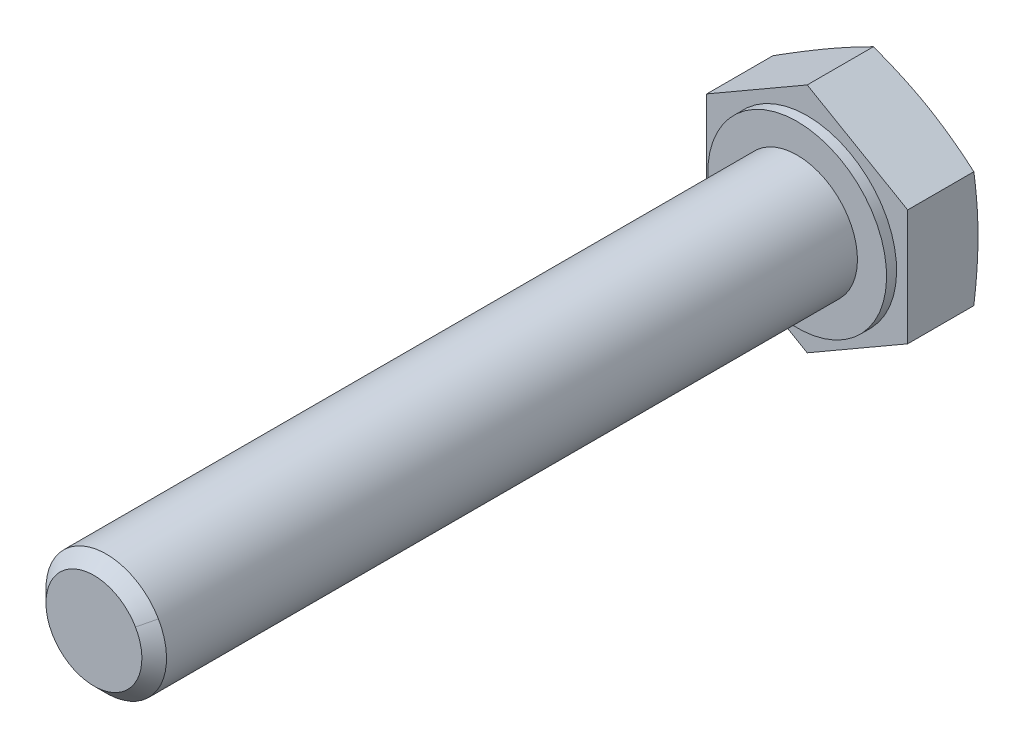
ISO-10303-21;
HEADER;
FILE_DESCRIPTION(('STEP AP214'),'2;1');
FILE_NAME('part.step','',(''),(''),'','','');
FILE_SCHEMA(('AUTOMOTIVE_DESIGN { 1 0 10303 214 1 1 1 1 }'));
ENDSEC;
DATA;
#1=APPLICATION_CONTEXT('core data for automotive mechanical design processes');
#2=APPLICATION_PROTOCOL_DEFINITION('international standard','automotive_design',2000,#1);
#3=PRODUCT_CONTEXT('',#1,'mechanical');
#4=PRODUCT('Part','Part','',(#3));
#5=PRODUCT_RELATED_PRODUCT_CATEGORY('part','',(#4));
#6=PRODUCT_DEFINITION_FORMATION('','',#4);
#7=PRODUCT_DEFINITION_CONTEXT('part definition',#1,'design');
#8=PRODUCT_DEFINITION('design','',#6,#7);
#9=PRODUCT_DEFINITION_SHAPE('','',#8);
#10=(LENGTH_UNIT() NAMED_UNIT(*) SI_UNIT(.MILLI.,.METRE.));
#11=(NAMED_UNIT(*) PLANE_ANGLE_UNIT() SI_UNIT($,.RADIAN.));
#12=(NAMED_UNIT(*) SI_UNIT($,.STERADIAN.) SOLID_ANGLE_UNIT());
#13=UNCERTAINTY_MEASURE_WITH_UNIT(LENGTH_MEASURE(1.E-05),#10,'distance_accuracy_value','');
#14=(GEOMETRIC_REPRESENTATION_CONTEXT(3) GLOBAL_UNCERTAINTY_ASSIGNED_CONTEXT((#13)) GLOBAL_UNIT_ASSIGNED_CONTEXT((#10,
#11,#12)) REPRESENTATION_CONTEXT('',''));
#15=CARTESIAN_POINT('',(0.,0.,0.));
#16=DIRECTION('',(0.,0.,1.));
#17=DIRECTION('',(1.,0.,0.));
#18=AXIS2_PLACEMENT_3D('',#15,#16,#17);
#19=CARTESIAN_POINT('',(2.16506350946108,1.25000000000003,0.));
#20=DIRECTION('',(0.,0.,-1.));
#21=DIRECTION('',(0.866025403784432,0.500000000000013,0.));
#22=AXIS2_PLACEMENT_3D('',#19,#20,#21);
#23=PLANE('',#22);
#24=CARTESIAN_POINT('',(0.,0.,-6.63927463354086E-12));
#25=DIRECTION('',(0.,0.,1.));
#26=DIRECTION('',(-0.866025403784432,-0.500000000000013,0.));
#27=AXIS2_PLACEMENT_3D('',#24,#25,#26);
#28=CIRCLE('',#27,4.99999999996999);
#29=CARTESIAN_POINT('',(-2.49999999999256,4.33012701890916,-2.61842660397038E-12));
#30=VERTEX_POINT('',#29);
#31=CARTESIAN_POINT('',(-4.99999999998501,0.,-2.61366202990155E-12));
#32=VERTEX_POINT('',#31);
#33=EDGE_CURVE('E102',#30,#32,#28,.T.);
#34=ORIENTED_EDGE('',*,*,#33,.F.);
#35=CARTESIAN_POINT('',(0.,0.,-6.63978962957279E-12));
#36=DIRECTION('',(0.,0.,1.));
#37=DIRECTION('',(-0.866025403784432,-0.500000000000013,0.));
#38=AXIS2_PLACEMENT_3D('',#35,#36,#37);
#39=CIRCLE('',#38,4.99999999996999);
#40=CARTESIAN_POINT('',(2.49999999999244,4.33012701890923,-2.62254361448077E-12));
#41=VERTEX_POINT('',#40);
#42=EDGE_CURVE('E117',#41,#30,#39,.T.);
#43=ORIENTED_EDGE('',*,*,#42,.F.);
#44=CARTESIAN_POINT('',(0.,0.,-6.63927463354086E-12));
#45=DIRECTION('',(0.,0.,1.));
#46=DIRECTION('',(-0.866025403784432,-0.500000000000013,0.));
#47=AXIS2_PLACEMENT_3D('',#44,#45,#46);
#48=CIRCLE('',#47,4.99999999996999);
#49=CARTESIAN_POINT('',(4.33012701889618,2.49999999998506,-6.6395042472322E-12));
#50=VERTEX_POINT('',#49);
#51=EDGE_CURVE('E125',#50,#41,#48,.T.);
#52=ORIENTED_EDGE('',*,*,#51,.F.);
#53=CARTESIAN_POINT('',(0.,0.,-6.63978962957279E-12));
#54=DIRECTION('',(0.,0.,1.));
#55=DIRECTION('',(-0.866025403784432,-0.500000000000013,0.));
#56=AXIS2_PLACEMENT_3D('',#53,#54,#55);
#57=CIRCLE('',#56,4.99999999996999);
#58=CARTESIAN_POINT('',(4.999999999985,0.,-2.61392716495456E-12));
#59=VERTEX_POINT('',#58);
#60=EDGE_CURVE('E382',#59,#50,#57,.T.);
#61=ORIENTED_EDGE('',*,*,#60,.F.);
#62=CARTESIAN_POINT('',(0.,0.,-6.63927463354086E-12));
#63=DIRECTION('',(0.,0.,1.));
#64=DIRECTION('',(-0.866025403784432,-0.500000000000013,0.));
#65=AXIS2_PLACEMENT_3D('',#62,#63,#64);
#66=CIRCLE('',#65,4.99999999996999);
#67=CARTESIAN_POINT('',(2.49999999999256,-4.33012701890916,-2.61816146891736E-12));
#68=VERTEX_POINT('',#67);
#69=EDGE_CURVE('E357',#68,#59,#66,.T.);
#70=ORIENTED_EDGE('',*,*,#69,.F.);
#71=CARTESIAN_POINT('',(0.,0.,-6.63878674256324E-12));
#72=DIRECTION('',(0.,0.,1.));
#73=DIRECTION('',(-0.866025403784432,-0.500000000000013,0.));
#74=AXIS2_PLACEMENT_3D('',#71,#72,#73);
#75=CIRCLE('',#74,4.99999999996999);
#76=CARTESIAN_POINT('',(-2.49999999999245,-4.33012701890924,-2.62152545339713E-12));
#77=VERTEX_POINT('',#76);
#78=EDGE_CURVE('E379',#77,#68,#75,.T.);
#79=ORIENTED_EDGE('',*,*,#78,.F.);
#80=CARTESIAN_POINT('',(0.,0.,-6.63927463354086E-12));
#81=DIRECTION('',(0.,0.,1.));
#82=DIRECTION('',(-0.866025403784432,-0.500000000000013,0.));
#83=AXIS2_PLACEMENT_3D('',#80,#81,#82);
#84=CIRCLE('',#83,4.99999999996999);
#85=CARTESIAN_POINT('',(-4.33012701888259,-2.49999999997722,-6.63904501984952E-12));
#86=VERTEX_POINT('',#85);
#87=EDGE_CURVE('E105',#86,#77,#84,.T.);
#88=ORIENTED_EDGE('',*,*,#87,.F.);
#89=CARTESIAN_POINT('',(0.,0.,-6.63878674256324E-12));
#90=DIRECTION('',(0.,0.,1.));
#91=DIRECTION('',(-0.866025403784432,-0.500000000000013,0.));
#92=AXIS2_PLACEMENT_3D('',#89,#90,#91);
#93=CIRCLE('',#92,4.99999999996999);
#94=EDGE_CURVE('E17',#32,#86,#93,.T.);
#95=ORIENTED_EDGE('',*,*,#94,.F.);
#96=EDGE_LOOP('',(#34,#43,#52,#61,#70,#79,#88,#95));
#97=FACE_BOUND('',#96,.T.);
#98=ADVANCED_FACE('F14',(#97),#23,.T.);
#99=CARTESIAN_POINT('',(0.,0.,0.208502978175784));
#100=DIRECTION('',(0.,0.,1.));
#101=DIRECTION('',(-0.866025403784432,-0.500000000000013,0.));
#102=AXIS2_PLACEMENT_3D('',#99,#100,#101);
#103=CONICAL_SURFACE('',#102,5.7781437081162,1.30899693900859);
#104=CARTESIAN_POINT('',(-5.,-2.88675134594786,0.207259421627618));
#105=CARTESIAN_POINT('',(-5.,-2.64743939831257,0.175186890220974));
#106=CARTESIAN_POINT('',(-5.00000000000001,-2.40769790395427,0.146063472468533));
#107=CARTESIAN_POINT('',(-5.00000000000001,-1.92774013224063,0.0949189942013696));
#108=CARTESIAN_POINT('',(-5.00000000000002,-1.68752470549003,0.072889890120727));
#109=CARTESIAN_POINT('',(-5.00000000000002,-1.20640156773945,0.0370556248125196));
#110=CARTESIAN_POINT('',(-5.00000000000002,-0.96549370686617,0.0232524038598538));
#111=CARTESIAN_POINT('',(-5.00000000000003,-0.60374322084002,0.00935120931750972));
#112=CARTESIAN_POINT('',(-5.00000000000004,-0.483024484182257,0.00585136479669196));
#113=CARTESIAN_POINT('',(-5.00000000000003,-0.241538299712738,0.00117297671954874));
#114=CARTESIAN_POINT('',(-5.00000000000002,-0.12077085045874,-5.49214909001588E-06));
#115=CARTESIAN_POINT('',(-5.,0.,1.41184511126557E-12));
#116=B_SPLINE_CURVE_WITH_KNOTS('',3,(#104,#105,#106,#107,#108,#109,#110,#111,#112,#113,#114,
#115),.UNSPECIFIED.,.F.,.F.,(4,2,2,2,2,4),(0.,0.724386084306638,1.44794794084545,
2.17168039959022,2.5339691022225,2.89626946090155),.UNSPECIFIED.);
#117=CARTESIAN_POINT('',(-5.00000000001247,-2.88675134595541,0.207259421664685));
#118=VERTEX_POINT('',#117);
#119=EDGE_CURVE('E110',#118,#32,#116,.T.);
#120=ORIENTED_EDGE('',*,*,#119,.T.);
#121=ORIENTED_EDGE('',*,*,#94,.T.);
#122=DIRECTION('',(0.836516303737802,0.482962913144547,-0.258819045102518));
#123=VECTOR('',#122,1.);
#124=CARTESIAN_POINT('',(-432187.37968241,-249523.500000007,133717.900889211));
#125=LINE('',#124,#123);
#126=EDGE_CURVE('E108',#118,#86,#125,.T.);
#127=ORIENTED_EDGE('',*,*,#126,.F.);
#128=EDGE_LOOP('',(#120,#121,#127));
#129=FACE_BOUND('',#128,.T.);
#130=ADVANCED_FACE('F111',(#129),#103,.T.);
#131=CARTESIAN_POINT('',(0.,0.,0.208502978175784));
#132=DIRECTION('',(0.,0.,1.));
#133=DIRECTION('',(-0.866025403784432,-0.500000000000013,0.));
#134=AXIS2_PLACEMENT_3D('',#131,#132,#133);
#135=CONICAL_SURFACE('',#134,5.7781437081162,1.30899693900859);
#136=ORIENTED_EDGE('',*,*,#87,.T.);
#137=CARTESIAN_POINT('',(-2.49999999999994,-4.33012701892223,1.39498280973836E-12));
#138=CARTESIAN_POINT('',(-2.60459062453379,-4.26974159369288,-5.49214910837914E-06));
#139=CARTESIAN_POINT('',(-2.709178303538,-4.20935786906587,0.00117297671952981));
#140=CARTESIAN_POINT('',(-2.91831147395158,-4.08861477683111,0.00585136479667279));
#141=CARTESIAN_POINT('',(-3.02285696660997,-4.02825540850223,0.00935120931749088));
#142=CARTESIAN_POINT('',(-3.33614207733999,-3.84738016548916,0.0232524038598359));
#143=CARTESIAN_POINT('',(-3.54477440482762,-3.72692623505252,0.0370556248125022));
#144=CARTESIAN_POINT('',(-3.96143926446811,-3.48636466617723,0.0728898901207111));
#145=CARTESIAN_POINT('',(-4.16947192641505,-3.36625695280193,0.0949189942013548));
#146=CARTESIAN_POINT('',(-4.58512754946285,-3.12627806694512,0.14606347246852));
#147=CARTESIAN_POINT('',(-4.7927497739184,-3.00640731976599,0.175186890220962));
#148=CARTESIAN_POINT('',(-4.99999999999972,-2.88675134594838,0.207259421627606));
#149=B_SPLINE_CURVE_WITH_KNOTS('',3,(#137,#138,#139,#140,#141,#142,#143,#144,#145,#146,#147,
#148),.UNSPECIFIED.,.F.,.F.,(4,2,2,2,2,4),(0.,0.362300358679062,0.724589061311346,
1.44832152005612,2.17188337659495,2.8962694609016),.UNSPECIFIED.);
#150=EDGE_CURVE('E133',#77,#118,#149,.T.);
#151=ORIENTED_EDGE('',*,*,#150,.T.);
#152=ORIENTED_EDGE('',*,*,#126,.T.);
#153=EDGE_LOOP('',(#136,#151,#152));
#154=FACE_BOUND('',#153,.T.);
#155=ADVANCED_FACE('F416',(#154),#135,.T.);
#156=CARTESIAN_POINT('',(0.,0.,0.208502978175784));
#157=DIRECTION('',(0.,0.,1.));
#158=DIRECTION('',(-0.866025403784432,-0.500000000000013,0.));
#159=AXIS2_PLACEMENT_3D('',#156,#157,#158);
#160=CONICAL_SURFACE('',#159,5.7781437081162,1.30899693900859);
#161=CARTESIAN_POINT('',(1.16053000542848E-12,-5.77350269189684,0.207259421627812));
#162=CARTESIAN_POINT('',(-0.207250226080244,-5.65384671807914,0.175186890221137));
#163=CARTESIAN_POINT('',(-0.414872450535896,-5.53397597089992,0.146063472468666));
#164=CARTESIAN_POINT('',(-0.830528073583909,-5.29399708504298,0.0949189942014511));
#165=CARTESIAN_POINT('',(-1.03856073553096,-5.17388937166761,0.0728898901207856));
#166=CARTESIAN_POINT('',(-1.45522559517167,-4.9333278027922,0.0370556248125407));
#167=CARTESIAN_POINT('',(-1.66385792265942,-4.8128738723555,0.0232524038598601));
#168=CARTESIAN_POINT('',(-1.9771430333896,-4.63199862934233,0.00935120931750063));
#169=CARTESIAN_POINT('',(-2.08168852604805,-4.57163926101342,0.00585136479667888));
#170=CARTESIAN_POINT('',(-2.29082169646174,-4.4508961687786,0.00117297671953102));
#171=CARTESIAN_POINT('',(-2.39540937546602,-4.39051244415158,-5.49214910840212E-06));
#172=CARTESIAN_POINT('',(-2.49999999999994,-4.33012701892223,1.39498280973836E-12));
#173=B_SPLINE_CURVE_WITH_KNOTS('',3,(#161,#162,#163,#164,#165,#166,#167,#168,#169,#170,#171,
#172),.UNSPECIFIED.,.F.,.F.,(4,2,2,2,2,4),(0.,0.724386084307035,1.44794794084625,
2.17168039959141,2.53396910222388,2.89626946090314),.UNSPECIFIED.);
#174=CARTESIAN_POINT('',(1.20563281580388E-13,-5.77350269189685,0.207259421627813));
#175=VERTEX_POINT('',#174);
#176=EDGE_CURVE('E130',#175,#77,#173,.T.);
#177=ORIENTED_EDGE('',*,*,#176,.T.);
#178=ORIENTED_EDGE('',*,*,#78,.T.);
#179=CARTESIAN_POINT('',(2.50000000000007,-4.33012701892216,1.40284623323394E-12));
#180=CARTESIAN_POINT('',(2.39540937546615,-4.39051244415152,-5.49214910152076E-06));
#181=CARTESIAN_POINT('',(2.29082169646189,-4.45089616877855,0.00117297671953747));
#182=CARTESIAN_POINT('',(2.0816885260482,-4.57163926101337,0.0058513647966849));
#183=CARTESIAN_POINT('',(1.97714303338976,-4.63199862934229,0.00935120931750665));
#184=CARTESIAN_POINT('',(1.66385792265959,-4.81287387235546,0.0232524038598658));
#185=CARTESIAN_POINT('',(1.45522559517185,-4.93332780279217,0.0370556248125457));
#186=CARTESIAN_POINT('',(1.03856073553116,-5.17388937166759,0.0728898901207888));
#187=CARTESIAN_POINT('',(0.83052807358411,-5.29399708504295,0.094918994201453));
#188=CARTESIAN_POINT('',(0.414872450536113,-5.53397597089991,0.146063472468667));
#189=CARTESIAN_POINT('',(0.20725022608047,-5.65384671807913,0.175186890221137));
#190=CARTESIAN_POINT('',(-9.22872889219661E-13,-5.77350269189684,0.207259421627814));
#191=B_SPLINE_CURVE_WITH_KNOTS('',3,(#179,#180,#181,#182,#183,#184,#185,#186,#187,#188,#189,
#190),.UNSPECIFIED.,.F.,.F.,(4,2,2,2,2,4),(0.,0.362300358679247,0.724589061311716,
1.44832152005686,2.17188337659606,2.89626946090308),.UNSPECIFIED.);
#192=EDGE_CURVE('E237',#68,#175,#191,.T.);
#193=ORIENTED_EDGE('',*,*,#192,.T.);
#194=EDGE_LOOP('',(#177,#178,#193));
#195=FACE_BOUND('',#194,.T.);
#196=ADVANCED_FACE('F411',(#195),#160,.T.);
#197=CARTESIAN_POINT('',(0.,0.,0.208502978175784));
#198=DIRECTION('',(0.,0.,1.));
#199=DIRECTION('',(-0.866025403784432,-0.500000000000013,0.));
#200=AXIS2_PLACEMENT_3D('',#197,#198,#199);
#201=CONICAL_SURFACE('',#200,5.7781437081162,1.30899693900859);
#202=CARTESIAN_POINT('',(5.,2.88675134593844,0.207259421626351));
#203=CARTESIAN_POINT('',(5.,2.64743939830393,0.175186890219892));
#204=CARTESIAN_POINT('',(5.00000000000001,2.4076979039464,0.146063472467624));
#205=CARTESIAN_POINT('',(5.00000000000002,1.92774013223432,0.0949189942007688));
#206=CARTESIAN_POINT('',(5.00000000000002,1.68752470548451,0.0728898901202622));
#207=CARTESIAN_POINT('',(5.00000000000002,1.20640156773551,0.03705562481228));
#208=CARTESIAN_POINT('',(5.00000000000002,0.965493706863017,0.0232524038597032));
#209=CARTESIAN_POINT('',(5.00000000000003,0.603743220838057,0.00935120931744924));
#210=CARTESIAN_POINT('',(5.00000000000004,0.483024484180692,0.0058513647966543));
#211=CARTESIAN_POINT('',(5.00000000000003,0.241538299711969,0.00117297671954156));
#212=CARTESIAN_POINT('',(5.00000000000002,0.120770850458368,-5.49214908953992E-06));
#213=CARTESIAN_POINT('',(5.,1.02348685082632E-13,1.41209497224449E-12));
#214=B_SPLINE_CURVE_WITH_KNOTS('',3,(#202,#203,#204,#205,#206,#207,#208,#209,#210,#211,#212,
#213),.UNSPECIFIED.,.F.,.F.,(4,2,2,2,2,4),(0.,0.724386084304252,1.44794794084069,
2.17168039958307,2.53396910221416,2.89626946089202),.UNSPECIFIED.);
#215=CARTESIAN_POINT('',(5.00000000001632,2.88675134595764,0.207259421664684));
#216=VERTEX_POINT('',#215);
#217=EDGE_CURVE('E216',#216,#59,#214,.T.);
#218=ORIENTED_EDGE('',*,*,#217,.T.);
#219=ORIENTED_EDGE('',*,*,#60,.T.);
#220=DIRECTION('',(-0.836516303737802,-0.482962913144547,-0.258819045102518));
#221=VECTOR('',#220,1.);
#222=CARTESIAN_POINT('',(432187.37968241,249523.500000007,133717.900889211));
#223=LINE('',#222,#221);
#224=EDGE_CURVE('E354',#216,#50,#223,.T.);
#225=ORIENTED_EDGE('',*,*,#224,.F.);
#226=EDGE_LOOP('',(#218,#219,#225));
#227=FACE_BOUND('',#226,.T.);
#228=ADVANCED_FACE('F226',(#227),#201,.T.);
#229=CARTESIAN_POINT('',(0.,0.,0.208502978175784));
#230=DIRECTION('',(0.,0.,1.));
#231=DIRECTION('',(-0.866025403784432,-0.500000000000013,0.));
#232=AXIS2_PLACEMENT_3D('',#229,#230,#231);
#233=CONICAL_SURFACE('',#232,5.7781437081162,1.30899693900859);
#234=CARTESIAN_POINT('',(5.0000000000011,-2.88675134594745,0.207259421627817));
#235=CARTESIAN_POINT('',(4.7927497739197,-3.00640731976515,0.175186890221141));
#236=CARTESIAN_POINT('',(4.58512754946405,-3.12627806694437,0.146063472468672));
#237=CARTESIAN_POINT('',(4.16947192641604,-3.36625695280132,0.0949189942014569));
#238=CARTESIAN_POINT('',(3.96143926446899,-3.48636466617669,0.0728898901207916));
#239=CARTESIAN_POINT('',(3.54477440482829,-3.72692623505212,0.037055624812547));
#240=CARTESIAN_POINT('',(3.33614207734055,-3.84738016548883,0.0232524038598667));
#241=CARTESIAN_POINT('',(3.02285696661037,-4.028255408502,0.00935120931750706));
#242=CARTESIAN_POINT('',(2.91831147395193,-4.08861477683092,0.00585136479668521));
#243=CARTESIAN_POINT('',(2.70917830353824,-4.20935786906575,0.00117297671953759));
#244=CARTESIAN_POINT('',(2.60459062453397,-4.26974159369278,-5.49214910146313E-06));
#245=CARTESIAN_POINT('',(2.50000000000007,-4.33012701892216,1.40284623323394E-12));
#246=B_SPLINE_CURVE_WITH_KNOTS('',3,(#234,#235,#236,#237,#238,#239,#240,#241,#242,#243,#244,
#245),.UNSPECIFIED.,.F.,.F.,(4,2,2,2,2,4),(0.,0.724386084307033,1.44794794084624,
2.1716803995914,2.53396910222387,2.89626946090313),.UNSPECIFIED.);
#247=CARTESIAN_POINT('',(5.00000000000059,-2.88675134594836,0.207259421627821));
#248=VERTEX_POINT('',#247);
#249=EDGE_CURVE('E231',#248,#68,#246,.T.);
#250=ORIENTED_EDGE('',*,*,#249,.T.);
#251=ORIENTED_EDGE('',*,*,#69,.T.);
#252=CARTESIAN_POINT('',(5.,1.02348685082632E-13,1.41209497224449E-12));
#253=CARTESIAN_POINT('',(5.00000000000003,-0.120770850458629,-5.49214909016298E-06));
#254=CARTESIAN_POINT('',(5.00000000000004,-0.241538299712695,0.00117297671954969));
#255=CARTESIAN_POINT('',(5.00000000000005,-0.483024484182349,0.00585136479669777));
#256=CARTESIAN_POINT('',(5.00000000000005,-0.60374322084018,0.00935120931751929));
#257=CARTESIAN_POINT('',(5.00000000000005,-0.96549370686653,0.0232524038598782));
#258=CARTESIAN_POINT('',(5.00000000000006,-1.20640156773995,0.0370556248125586));
#259=CARTESIAN_POINT('',(5.00000000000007,-1.68752470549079,0.0728898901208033));
#260=CARTESIAN_POINT('',(5.00000000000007,-1.92774013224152,0.0949189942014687));
#261=CARTESIAN_POINT('',(5.00000000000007,-2.40769790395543,0.146063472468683));
#262=CARTESIAN_POINT('',(5.00000000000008,-2.64743939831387,0.175186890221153));
#263=CARTESIAN_POINT('',(5.00000000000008,-2.88675134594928,0.207259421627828));
#264=B_SPLINE_CURVE_WITH_KNOTS('',3,(#252,#253,#254,#255,#256,#257,#258,#259,#260,#261,#262,
#263),.UNSPECIFIED.,.F.,.F.,(4,2,2,2,2,4),(0.,0.362300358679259,0.724589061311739,
1.44832152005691,2.17188337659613,2.89626946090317),.UNSPECIFIED.);
#265=EDGE_CURVE('E210',#59,#248,#264,.T.);
#266=ORIENTED_EDGE('',*,*,#265,.T.);
#267=EDGE_LOOP('',(#250,#251,#266));
#268=FACE_BOUND('',#267,.T.);
#269=ADVANCED_FACE('F223',(#268),#233,.T.);
#270=CARTESIAN_POINT('',(0.,0.,0.208502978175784));
#271=DIRECTION('',(0.,0.,1.));
#272=DIRECTION('',(-0.866025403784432,-0.500000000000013,0.));
#273=AXIS2_PLACEMENT_3D('',#270,#271,#272);
#274=CONICAL_SURFACE('',#273,5.7781437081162,1.30899693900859);
#275=ORIENTED_EDGE('',*,*,#51,.T.);
#276=CARTESIAN_POINT('',(2.49999999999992,4.33012701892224,1.39496753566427E-12));
#277=CARTESIAN_POINT('',(2.60459062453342,4.26974159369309,-5.49214910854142E-06));
#278=CARTESIAN_POINT('',(2.70917830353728,4.20935786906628,0.00117297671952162));
#279=CARTESIAN_POINT('',(2.91831147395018,4.08861477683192,0.00585136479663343));
#280=CARTESIAN_POINT('',(3.02285696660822,4.02825540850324,0.00935120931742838));
#281=CARTESIAN_POINT('',(3.33614207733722,3.84738016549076,0.0232524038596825));
#282=CARTESIAN_POINT('',(3.54477440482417,3.72692623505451,0.0370556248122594));
#283=CARTESIAN_POINT('',(3.96143926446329,3.48636466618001,0.0728898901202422));
#284=CARTESIAN_POINT('',(4.16947192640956,3.36625695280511,0.0949189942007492));
#285=CARTESIAN_POINT('',(4.585127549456,3.12627806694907,0.146063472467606));
#286=CARTESIAN_POINT('',(4.79274977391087,3.00640731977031,0.175186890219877));
#287=CARTESIAN_POINT('',(4.99999999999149,2.88675134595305,0.20725942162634));
#288=B_SPLINE_CURVE_WITH_KNOTS('',3,(#276,#277,#278,#279,#280,#281,#282,#283,#284,#285,#286,
#287),.UNSPECIFIED.,.F.,.F.,(4,2,2,2,2,4),(0.,0.36230035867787,0.724589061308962,
1.44832152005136,2.17188337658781,2.89626946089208),.UNSPECIFIED.);
#289=EDGE_CURVE('E178',#41,#216,#288,.T.);
#290=ORIENTED_EDGE('',*,*,#289,.T.);
#291=ORIENTED_EDGE('',*,*,#224,.T.);
#292=EDGE_LOOP('',(#275,#290,#291));
#293=FACE_BOUND('',#292,.T.);
#294=ADVANCED_FACE('F159',(#293),#274,.T.);
#295=CARTESIAN_POINT('',(0.,0.,0.208502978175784));
#296=DIRECTION('',(0.,0.,1.));
#297=DIRECTION('',(-0.866025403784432,-0.500000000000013,0.));
#298=AXIS2_PLACEMENT_3D('',#295,#296,#297);
#299=CONICAL_SURFACE('',#298,5.7781437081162,1.30899693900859);
#300=ORIENTED_EDGE('',*,*,#33,.T.);
#301=CARTESIAN_POINT('',(-5.,0.,1.41184511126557E-12));
#302=CARTESIAN_POINT('',(-5.00000000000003,0.120770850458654,-5.49214909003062E-06));
#303=CARTESIAN_POINT('',(-5.00000000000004,0.241538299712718,0.00117297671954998));
#304=CARTESIAN_POINT('',(-5.00000000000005,0.483024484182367,0.00585136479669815));
#305=CARTESIAN_POINT('',(-5.00000000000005,0.603743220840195,0.00935120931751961));
#306=CARTESIAN_POINT('',(-5.00000000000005,0.96549370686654,0.0232524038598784));
#307=CARTESIAN_POINT('',(-5.00000000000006,1.20640156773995,0.0370556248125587));
#308=CARTESIAN_POINT('',(-5.00000000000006,1.68752470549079,0.0728898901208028));
#309=CARTESIAN_POINT('',(-5.00000000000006,1.92774013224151,0.0949189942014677));
#310=CARTESIAN_POINT('',(-5.00000000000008,2.40769790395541,0.146063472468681));
#311=CARTESIAN_POINT('',(-5.00000000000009,2.64743939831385,0.175186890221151));
#312=CARTESIAN_POINT('',(-5.00000000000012,2.88675134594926,0.207259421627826));
#313=B_SPLINE_CURVE_WITH_KNOTS('',3,(#301,#302,#303,#304,#305,#306,#307,#308,#309,#310,#311,
#312),.UNSPECIFIED.,.F.,.F.,(4,2,2,2,2,4),(0.,0.362300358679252,0.724589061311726,
1.44832152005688,2.17188337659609,2.89626946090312),.UNSPECIFIED.);
#314=CARTESIAN_POINT('',(-5.,2.88675134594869,0.207259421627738));
#315=VERTEX_POINT('',#314);
#316=EDGE_CURVE('E116',#32,#315,#313,.T.);
#317=ORIENTED_EDGE('',*,*,#316,.T.);
#318=CARTESIAN_POINT('',(-5.00000000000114,2.88675134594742,0.207259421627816));
#319=CARTESIAN_POINT('',(-4.79274977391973,3.00640731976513,0.175186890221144));
#320=CARTESIAN_POINT('',(-4.58512754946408,3.12627806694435,0.146063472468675));
#321=CARTESIAN_POINT('',(-4.16947192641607,3.36625695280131,0.0949189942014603));
#322=CARTESIAN_POINT('',(-3.96143926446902,3.48636466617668,0.072889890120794));
#323=CARTESIAN_POINT('',(-3.54477440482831,3.72692623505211,0.0370556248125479));
#324=CARTESIAN_POINT('',(-3.33614207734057,3.84738016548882,0.023252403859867));
#325=CARTESIAN_POINT('',(-3.02285696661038,4.028255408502,0.0093512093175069));
#326=CARTESIAN_POINT('',(-2.91831147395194,4.08861477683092,0.00585136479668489));
#327=CARTESIAN_POINT('',(-2.70917830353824,4.20935786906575,0.00117297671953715));
#328=CARTESIAN_POINT('',(-2.60459062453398,4.26974159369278,-5.49214910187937E-06));
#329=CARTESIAN_POINT('',(-2.50000000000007,4.33012701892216,1.40258109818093E-12));
#330=B_SPLINE_CURVE_WITH_KNOTS('',3,(#318,#319,#320,#321,#322,#323,#324,#325,#326,#327,#328,
#329),.UNSPECIFIED.,.F.,.F.,(4,2,2,2,2,4),(0.,0.724386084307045,1.44794794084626,
2.17168039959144,2.53396910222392,2.89626946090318),.UNSPECIFIED.);
#331=EDGE_CURVE('E123',#315,#30,#330,.T.);
#332=ORIENTED_EDGE('',*,*,#331,.T.);
#333=EDGE_LOOP('',(#300,#317,#332));
#334=FACE_BOUND('',#333,.T.);
#335=ADVANCED_FACE('F120',(#334),#299,.T.);
#336=CARTESIAN_POINT('',(0.,0.,0.208502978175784));
#337=DIRECTION('',(0.,0.,1.));
#338=DIRECTION('',(-0.866025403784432,-0.500000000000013,0.));
#339=AXIS2_PLACEMENT_3D('',#336,#337,#338);
#340=CONICAL_SURFACE('',#339,5.7781437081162,1.30899693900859);
#341=ORIENTED_EDGE('',*,*,#42,.T.);
#342=CARTESIAN_POINT('',(-2.50000000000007,4.33012701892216,1.40258109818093E-12));
#343=CARTESIAN_POINT('',(-2.39540937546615,4.39051244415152,-5.49214910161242E-06));
#344=CARTESIAN_POINT('',(-2.29082169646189,4.45089616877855,0.00117297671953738));
#345=CARTESIAN_POINT('',(-2.0816885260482,4.57163926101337,0.00585136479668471));
#346=CARTESIAN_POINT('',(-1.97714303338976,4.63199862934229,0.00935120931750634));
#347=CARTESIAN_POINT('',(-1.66385792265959,4.81287387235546,0.0232524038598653));
#348=CARTESIAN_POINT('',(-1.45522559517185,4.93332780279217,0.0370556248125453));
#349=CARTESIAN_POINT('',(-1.03856073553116,5.17388937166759,0.0728898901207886));
#350=CARTESIAN_POINT('',(-0.83052807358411,5.29399708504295,0.0949189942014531));
#351=CARTESIAN_POINT('',(-0.414872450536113,5.53397597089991,0.146063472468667));
#352=CARTESIAN_POINT('',(-0.207250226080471,5.65384671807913,0.175186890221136));
#353=CARTESIAN_POINT('',(9.22872889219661E-13,5.77350269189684,0.207259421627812));
#354=B_SPLINE_CURVE_WITH_KNOTS('',3,(#342,#343,#344,#345,#346,#347,#348,#349,#350,#351,#352,
#353),.UNSPECIFIED.,.F.,.F.,(4,2,2,2,2,4),(0.,0.362300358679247,0.724589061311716,
1.44832152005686,2.17188337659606,2.89626946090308),.UNSPECIFIED.);
#355=CARTESIAN_POINT('',(-1.16226472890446E-13,5.77350269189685,0.207259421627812));
#356=VERTEX_POINT('',#355);
#357=EDGE_CURVE('E172',#30,#356,#354,.T.);
#358=ORIENTED_EDGE('',*,*,#357,.T.);
#359=CARTESIAN_POINT('',(-1.16920362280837E-12,5.77350269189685,0.207259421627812));
#360=CARTESIAN_POINT('',(0.207250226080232,5.65384671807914,0.175186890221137));
#361=CARTESIAN_POINT('',(0.414872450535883,5.53397597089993,0.146063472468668));
#362=CARTESIAN_POINT('',(0.830528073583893,5.29399708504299,0.0949189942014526));
#363=CARTESIAN_POINT('',(1.03856073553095,5.17388937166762,0.072889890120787));
#364=CARTESIAN_POINT('',(1.45522559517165,4.93332780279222,0.0370556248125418));
#365=CARTESIAN_POINT('',(1.6638579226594,4.81287387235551,0.0232524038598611));
#366=CARTESIAN_POINT('',(1.97714303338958,4.63199862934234,0.00935120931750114));
#367=CARTESIAN_POINT('',(2.08168852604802,4.57163926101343,0.00585136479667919));
#368=CARTESIAN_POINT('',(2.29082169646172,4.45089616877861,0.00117297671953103));
#369=CARTESIAN_POINT('',(2.39540937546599,4.39051244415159,-5.49214910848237E-06));
#370=CARTESIAN_POINT('',(2.49999999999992,4.33012701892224,1.39496753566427E-12));
#371=B_SPLINE_CURVE_WITH_KNOTS('',3,(#359,#360,#361,#362,#363,#364,#365,#366,#367,#368,#369,
#370),.UNSPECIFIED.,.F.,.F.,(4,2,2,2,2,4),(0.,0.724386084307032,1.44794794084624,
2.1716803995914,2.53396910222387,2.89626946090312),.UNSPECIFIED.);
#372=EDGE_CURVE('E202',#356,#41,#371,.T.);
#373=ORIENTED_EDGE('',*,*,#372,.T.);
#374=EDGE_LOOP('',(#341,#358,#373));
#375=FACE_BOUND('',#374,.T.);
#376=ADVANCED_FACE('F158',(#375),#340,.T.);
#377=CARTESIAN_POINT('',(-5.,-2.88675134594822,4.));
#378=DIRECTION('',(1.,0.,0.));
#379=DIRECTION('',(0.,1.,0.));
#380=AXIS2_PLACEMENT_3D('',#377,#378,#379);
#381=PLANE('',#380);
#382=DIRECTION('',(0.,0.,1.));
#383=VECTOR('',#382,1.);
#384=CARTESIAN_POINT('',(-5.,2.88675134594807,4.));
#385=LINE('',#384,#383);
#386=CARTESIAN_POINT('',(-5.,2.88675134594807,3.5));
#387=VERTEX_POINT('',#386);
#388=EDGE_CURVE('E129',#387,#315,#385,.F.);
#389=ORIENTED_EDGE('',*,*,#388,.T.);
#390=ORIENTED_EDGE('',*,*,#316,.F.);
#391=ORIENTED_EDGE('',*,*,#119,.F.);
#392=DIRECTION('',(0.,0.,1.));
#393=VECTOR('',#392,1.);
#394=CARTESIAN_POINT('',(-4.99999999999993,-2.88675134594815,4.));
#395=LINE('',#394,#393);
#396=CARTESIAN_POINT('',(-5.,-2.88675134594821,3.5));
#397=VERTEX_POINT('',#396);
#398=EDGE_CURVE('E238',#118,#397,#395,.T.);
#399=ORIENTED_EDGE('',*,*,#398,.T.);
#400=DIRECTION('',(0.,-1.,0.));
#401=VECTOR('',#400,1.);
#402=CARTESIAN_POINT('',(-5.,2.88675134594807,3.5));
#403=LINE('',#402,#401);
#404=EDGE_CURVE('E313',#387,#397,#403,.T.);
#405=ORIENTED_EDGE('',*,*,#404,.F.);
#406=EDGE_LOOP('',(#389,#390,#391,#399,#405));
#407=FACE_BOUND('',#406,.T.);
#408=ADVANCED_FACE('F127',(#407),#381,.F.);
#409=CARTESIAN_POINT('',(1.17093834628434E-13,-5.77350269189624,4.));
#410=DIRECTION('',(0.499999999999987,0.866025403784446,0.));
#411=DIRECTION('',(-0.866025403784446,0.499999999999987,0.));
#412=AXIS2_PLACEMENT_3D('',#409,#410,#411);
#413=PLANE('',#412);
#414=ORIENTED_EDGE('',*,*,#398,.F.);
#415=ORIENTED_EDGE('',*,*,#150,.F.);
#416=ORIENTED_EDGE('',*,*,#176,.F.);
#417=DIRECTION('',(0.,0.,1.));
#418=VECTOR('',#417,1.);
#419=CARTESIAN_POINT('',(1.17093834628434E-13,-5.77350269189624,4.));
#420=LINE('',#419,#418);
#421=CARTESIAN_POINT('',(1.17093834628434E-13,-5.77350269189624,3.5));
#422=VERTEX_POINT('',#421);
#423=EDGE_CURVE('E326',#175,#422,#420,.T.);
#424=ORIENTED_EDGE('',*,*,#423,.T.);
#425=DIRECTION('',(0.866025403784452,-0.499999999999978,0.));
#426=VECTOR('',#425,1.);
#427=CARTESIAN_POINT('',(-5.,-2.88675134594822,3.5));
#428=LINE('',#427,#426);
#429=EDGE_CURVE('E346',#397,#422,#428,.T.);
#430=ORIENTED_EDGE('',*,*,#429,.F.);
#431=EDGE_LOOP('',(#414,#415,#416,#424,#430));
#432=FACE_BOUND('',#431,.T.);
#433=ADVANCED_FACE('F251',(#432),#413,.F.);
#434=CARTESIAN_POINT('',(5.,-2.88675134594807,4.));
#435=DIRECTION('',(-0.500000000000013,0.866025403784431,0.));
#436=DIRECTION('',(-0.866025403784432,-0.500000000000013,0.));
#437=AXIS2_PLACEMENT_3D('',#434,#435,#436);
#438=PLANE('',#437);
#439=ORIENTED_EDGE('',*,*,#423,.F.);
#440=ORIENTED_EDGE('',*,*,#192,.F.);
#441=ORIENTED_EDGE('',*,*,#249,.F.);
#442=DIRECTION('',(0.,0.,1.));
#443=VECTOR('',#442,1.);
#444=CARTESIAN_POINT('',(5.00000000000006,-2.88675134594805,4.));
#445=LINE('',#444,#443);
#446=CARTESIAN_POINT('',(5.,-2.88675134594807,3.5));
#447=VERTEX_POINT('',#446);
#448=EDGE_CURVE('E209',#248,#447,#445,.T.);
#449=ORIENTED_EDGE('',*,*,#448,.T.);
#450=DIRECTION('',(-0.866025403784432,-0.500000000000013,0.));
#451=VECTOR('',#450,1.);
#452=CARTESIAN_POINT('',(8.32402084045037,-0.967627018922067,3.5));
#453=LINE('',#452,#451);
#454=EDGE_CURVE('E351',#422,#447,#453,.F.);
#455=ORIENTED_EDGE('',*,*,#454,.F.);
#456=EDGE_LOOP('',(#439,#440,#441,#449,#455));
#457=FACE_BOUND('',#456,.T.);
#458=ADVANCED_FACE('F248',(#457),#438,.F.);
#459=CARTESIAN_POINT('',(5.,2.88675134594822,4.));
#460=DIRECTION('',(-1.,0.,0.));
#461=DIRECTION('',(0.,-1.,0.));
#462=AXIS2_PLACEMENT_3D('',#459,#460,#461);
#463=PLANE('',#462);
#464=ORIENTED_EDGE('',*,*,#448,.F.);
#465=ORIENTED_EDGE('',*,*,#265,.F.);
#466=ORIENTED_EDGE('',*,*,#217,.F.);
#467=DIRECTION('',(0.,0.,1.));
#468=VECTOR('',#467,1.);
#469=CARTESIAN_POINT('',(5.,2.88675134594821,4.));
#470=LINE('',#469,#468);
#471=CARTESIAN_POINT('',(5.,2.88675134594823,3.5));
#472=VERTEX_POINT('',#471);
#473=EDGE_CURVE('E317',#216,#472,#470,.T.);
#474=ORIENTED_EDGE('',*,*,#473,.T.);
#475=DIRECTION('',(0.,1.,0.));
#476=VECTOR('',#475,1.);
#477=CARTESIAN_POINT('',(5.,-2.88675134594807,3.5));
#478=LINE('',#477,#476);
#479=EDGE_CURVE('E341',#447,#472,#478,.T.);
#480=ORIENTED_EDGE('',*,*,#479,.F.);
#481=EDGE_LOOP('',(#464,#465,#466,#474,#480));
#482=FACE_BOUND('',#481,.T.);
#483=ADVANCED_FACE('F197',(#482),#463,.F.);
#484=CARTESIAN_POINT('',(-1.17093834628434E-13,5.77350269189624,4.));
#485=DIRECTION('',(-0.499999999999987,-0.866025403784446,0.));
#486=DIRECTION('',(0.866025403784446,-0.499999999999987,0.));
#487=AXIS2_PLACEMENT_3D('',#484,#485,#486);
#488=PLANE('',#487);
#489=ORIENTED_EDGE('',*,*,#473,.F.);
#490=ORIENTED_EDGE('',*,*,#289,.F.);
#491=ORIENTED_EDGE('',*,*,#372,.F.);
#492=DIRECTION('',(0.,0.,1.));
#493=VECTOR('',#492,1.);
#494=CARTESIAN_POINT('',(-1.17093834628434E-13,5.77350269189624,4.));
#495=LINE('',#494,#493);
#496=CARTESIAN_POINT('',(-1.17093834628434E-13,5.77350269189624,3.5));
#497=VERTEX_POINT('',#496);
#498=EDGE_CURVE('E311',#356,#497,#495,.T.);
#499=ORIENTED_EDGE('',*,*,#498,.T.);
#500=DIRECTION('',(-0.866025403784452,0.499999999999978,0.));
#501=VECTOR('',#500,1.);
#502=CARTESIAN_POINT('',(5.,2.88675134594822,3.5));
#503=LINE('',#502,#501);
#504=EDGE_CURVE('E336',#472,#497,#503,.T.);
#505=ORIENTED_EDGE('',*,*,#504,.F.);
#506=EDGE_LOOP('',(#489,#490,#491,#499,#505));
#507=FACE_BOUND('',#506,.T.);
#508=ADVANCED_FACE('F190',(#507),#488,.F.);
#509=CARTESIAN_POINT('',(-5.,2.88675134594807,4.));
#510=DIRECTION('',(0.500000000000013,-0.866025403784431,0.));
#511=DIRECTION('',(0.866025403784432,0.500000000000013,0.));
#512=AXIS2_PLACEMENT_3D('',#509,#510,#511);
#513=PLANE('',#512);
#514=ORIENTED_EDGE('',*,*,#498,.F.);
#515=ORIENTED_EDGE('',*,*,#357,.F.);
#516=ORIENTED_EDGE('',*,*,#331,.F.);
#517=ORIENTED_EDGE('',*,*,#388,.F.);
#518=DIRECTION('',(-0.866025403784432,-0.500000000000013,0.));
#519=VECTOR('',#518,1.);
#520=CARTESIAN_POINT('',(3.32402084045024,7.69262701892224,3.5));
#521=LINE('',#520,#519);
#522=EDGE_CURVE('E333',#497,#387,#521,.T.);
#523=ORIENTED_EDGE('',*,*,#522,.F.);
#524=EDGE_LOOP('',(#514,#515,#516,#517,#523));
#525=FACE_BOUND('',#524,.T.);
#526=ADVANCED_FACE('F185',(#525),#513,.F.);
#527=CARTESIAN_POINT('',(5.8240208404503,3.36250000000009,3.5));
#528=DIRECTION('',(0.,0.,1.));
#529=DIRECTION('',(-0.866025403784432,-0.500000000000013,0.));
#530=AXIS2_PLACEMENT_3D('',#527,#528,#529);
#531=PLANE('',#530);
#532=CARTESIAN_POINT('',(0.,0.,3.5));
#533=DIRECTION('',(0.,0.,1.));
#534=DIRECTION('',(-0.866025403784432,-0.500000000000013,0.));
#535=AXIS2_PLACEMENT_3D('',#532,#533,#534);
#536=CIRCLE('',#535,4.45);
#537=CARTESIAN_POINT('',(-3.85381304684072,-2.22500000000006,3.5));
#538=VERTEX_POINT('',#537);
#539=EDGE_CURVE('E301',#538,#538,#536,.T.);
#540=ORIENTED_EDGE('',*,*,#539,.F.);
#541=EDGE_LOOP('',(#540));
#542=FACE_BOUND('',#541,.T.);
#543=ORIENTED_EDGE('',*,*,#504,.T.);
#544=ORIENTED_EDGE('',*,*,#522,.T.);
#545=ORIENTED_EDGE('',*,*,#404,.T.);
#546=ORIENTED_EDGE('',*,*,#429,.T.);
#547=ORIENTED_EDGE('',*,*,#454,.T.);
#548=ORIENTED_EDGE('',*,*,#479,.T.);
#549=EDGE_LOOP('',(#543,#544,#545,#546,#547,#548));
#550=FACE_BOUND('',#549,.T.);
#551=ADVANCED_FACE('F189',(#542,#550),#531,.T.);
#552=CARTESIAN_POINT('',(1.03338481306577,0.596625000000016,39.));
#553=DIRECTION('',(0.,0.,1.));
#554=DIRECTION('',(0.500000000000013,-0.866025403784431,0.));
#555=AXIS2_PLACEMENT_3D('',#552,#553,#554);
#556=PLANE('',#555);
#557=CARTESIAN_POINT('',(0.,0.,38.9999999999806));
#558=DIRECTION('',(0.,0.,-1.));
#559=DIRECTION('',(0.866025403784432,0.500000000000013,0.));
#560=AXIS2_PLACEMENT_3D('',#557,#558,#559);
#561=CIRCLE('',#560,2.38650000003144);
#562=CARTESIAN_POINT('',(2.06676962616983,1.19325000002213,38.9999999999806));
#563=VERTEX_POINT('',#562);
#564=CARTESIAN_POINT('',(-2.06676962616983,-1.19325000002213,38.9999999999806));
#565=VERTEX_POINT('',#564);
#566=EDGE_CURVE('E293',#563,#565,#561,.T.);
#567=ORIENTED_EDGE('',*,*,#566,.F.);
#568=CARTESIAN_POINT('',(0.,0.,38.9999999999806));
#569=DIRECTION('',(0.,0.,-1.));
#570=DIRECTION('',(0.866025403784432,0.500000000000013,0.));
#571=AXIS2_PLACEMENT_3D('',#568,#569,#570);
#572=CIRCLE('',#571,2.38650000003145);
#573=EDGE_CURVE('E295',#565,#563,#572,.T.);
#574=ORIENTED_EDGE('',*,*,#573,.F.);
#575=EDGE_LOOP('',(#567,#574));
#576=FACE_BOUND('',#575,.T.);
#577=ADVANCED_FACE('F284',(#576),#556,.T.);
#578=CARTESIAN_POINT('',(0.,0.,38.3864999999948));
#579=DIRECTION('',(0.,0.,-1.));
#580=DIRECTION('',(0.866025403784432,0.500000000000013,0.));
#581=AXIS2_PLACEMENT_3D('',#578,#579,#580);
#582=CONICAL_SURFACE('',#581,3.00000000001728,0.785398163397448);
#583=DIRECTION('',(0.612372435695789,0.353553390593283,0.707106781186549));
#584=VECTOR('',#583,1.);
#585=CARTESIAN_POINT('',(-432182.345043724,-249520.593250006,-498999.8));
#586=LINE('',#585,#584);
#587=CARTESIAN_POINT('',(-2.5980762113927,-1.50000000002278,38.3864999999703));
#588=VERTEX_POINT('',#587);
#589=EDGE_CURVE('E296',#565,#588,#586,.F.);
#590=ORIENTED_EDGE('',*,*,#589,.F.);
#591=ORIENTED_EDGE('',*,*,#573,.T.);
#592=DIRECTION('',(-0.612372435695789,-0.353553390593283,0.707106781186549));
#593=VECTOR('',#592,1.);
#594=CARTESIAN_POINT('',(432182.345043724,249520.593250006,-498999.8));
#595=LINE('',#594,#593);
#596=CARTESIAN_POINT('',(2.59807621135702,1.50000000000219,38.3864999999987));
#597=VERTEX_POINT('',#596);
#598=EDGE_CURVE('E297',#597,#563,#595,.T.);
#599=ORIENTED_EDGE('',*,*,#598,.F.);
#600=CARTESIAN_POINT('',(0.,0.,38.3865));
#601=DIRECTION('',(0.,0.,1.));
#602=DIRECTION('',(-0.866025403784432,-0.500000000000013,0.));
#603=AXIS2_PLACEMENT_3D('',#600,#601,#602);
#604=CIRCLE('',#603,3.);
#605=EDGE_CURVE('E32',#588,#597,#604,.F.);
#606=ORIENTED_EDGE('',*,*,#605,.F.);
#607=EDGE_LOOP('',(#590,#591,#599,#606));
#608=FACE_BOUND('',#607,.T.);
#609=ADVANCED_FACE('F281',(#608),#582,.T.);
#610=CARTESIAN_POINT('',(0.,0.,3.75));
#611=DIRECTION('',(0.,0.,1.));
#612=DIRECTION('',(-0.866025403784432,-0.500000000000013,0.));
#613=AXIS2_PLACEMENT_3D('',#610,#611,#612);
#614=CYLINDRICAL_SURFACE('',#613,4.45);
#615=ORIENTED_EDGE('',*,*,#539,.T.);
#616=EDGE_LOOP('',(#615));
#617=FACE_BOUND('',#616,.T.);
#618=CARTESIAN_POINT('',(0.,0.,4.));
#619=DIRECTION('',(0.,0.,1.));
#620=DIRECTION('',(-0.866025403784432,-0.500000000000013,0.));
#621=AXIS2_PLACEMENT_3D('',#618,#619,#620);
#622=CIRCLE('',#621,4.45);
#623=CARTESIAN_POINT('',(-3.85381304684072,-2.22500000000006,4.));
#624=VERTEX_POINT('',#623);
#625=EDGE_CURVE('E367',#624,#624,#622,.T.);
#626=ORIENTED_EDGE('',*,*,#625,.F.);
#627=EDGE_LOOP('',(#626));
#628=FACE_BOUND('',#627,.T.);
#629=ADVANCED_FACE('F277',(#617,#628),#614,.T.);
#630=CARTESIAN_POINT('',(0.,0.,38.3864999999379));
#631=DIRECTION('',(0.,0.,-1.));
#632=DIRECTION('',(0.866025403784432,0.500000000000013,0.));
#633=AXIS2_PLACEMENT_3D('',#630,#631,#632);
#634=CONICAL_SURFACE('',#633,3.00000000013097,0.785398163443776);
#635=ORIENTED_EDGE('',*,*,#589,.T.);
#636=CARTESIAN_POINT('',(0.,0.,38.3865));
#637=DIRECTION('',(0.,0.,1.));
#638=DIRECTION('',(-0.866025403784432,-0.500000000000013,0.));
#639=AXIS2_PLACEMENT_3D('',#636,#637,#638);
#640=CIRCLE('',#639,3.);
#641=EDGE_CURVE('E23',#597,#588,#640,.F.);
#642=ORIENTED_EDGE('',*,*,#641,.F.);
#643=ORIENTED_EDGE('',*,*,#598,.T.);
#644=ORIENTED_EDGE('',*,*,#566,.T.);
#645=EDGE_LOOP('',(#635,#642,#643,#644));
#646=FACE_BOUND('',#645,.T.);
#647=ADVANCED_FACE('F270',(#646),#634,.T.);
#648=CARTESIAN_POINT('',(3.22594462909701,1.86250000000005,4.));
#649=DIRECTION('',(0.,0.,1.));
#650=DIRECTION('',(-0.866025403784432,-0.500000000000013,0.));
#651=AXIS2_PLACEMENT_3D('',#648,#649,#650);
#652=PLANE('',#651);
#653=CARTESIAN_POINT('',(0.,0.,4.));
#654=DIRECTION('',(0.,0.,1.));
#655=DIRECTION('',(-0.866025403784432,-0.500000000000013,0.));
#656=AXIS2_PLACEMENT_3D('',#653,#654,#655);
#657=CIRCLE('',#656,3.);
#658=CARTESIAN_POINT('',(-2.5980762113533,-1.50000000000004,4.));
#659=VERTEX_POINT('',#658);
#660=EDGE_CURVE('E9',#659,#659,#657,.T.);
#661=ORIENTED_EDGE('',*,*,#660,.F.);
#662=EDGE_LOOP('',(#661));
#663=FACE_BOUND('',#662,.T.);
#664=ORIENTED_EDGE('',*,*,#625,.T.);
#665=EDGE_LOOP('',(#664));
#666=FACE_BOUND('',#665,.T.);
#667=ADVANCED_FACE('F264',(#663,#666),#652,.T.);
#668=CARTESIAN_POINT('',(0.,0.,21.19325));
#669=DIRECTION('',(0.,0.,1.));
#670=DIRECTION('',(-0.866025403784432,-0.500000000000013,0.));
#671=AXIS2_PLACEMENT_3D('',#668,#669,#670);
#672=CYLINDRICAL_SURFACE('',#671,3.);
#673=ORIENTED_EDGE('',*,*,#605,.T.);
#674=ORIENTED_EDGE('',*,*,#641,.T.);
#675=EDGE_LOOP('',(#673,#674));
#676=FACE_BOUND('',#675,.T.);
#677=ORIENTED_EDGE('',*,*,#660,.T.);
#678=EDGE_LOOP('',(#677));
#679=FACE_BOUND('',#678,.T.);
#680=ADVANCED_FACE('F262',(#676,#679),#672,.T.);
#681=CLOSED_SHELL('',(#98,#130,#155,#196,#228,#269,#294,#335,#376,#408,#433,#458,#483,#508,#526,
#551,#577,#609,#629,#647,#667,#680));
#682=MANIFOLD_SOLID_BREP('B1',#681);
#683=ADVANCED_BREP_SHAPE_REPRESENTATION('',(#18,#682),#14);
#684=SHAPE_DEFINITION_REPRESENTATION(#9,#683);
ENDSEC;
END-ISO-10303-21;
